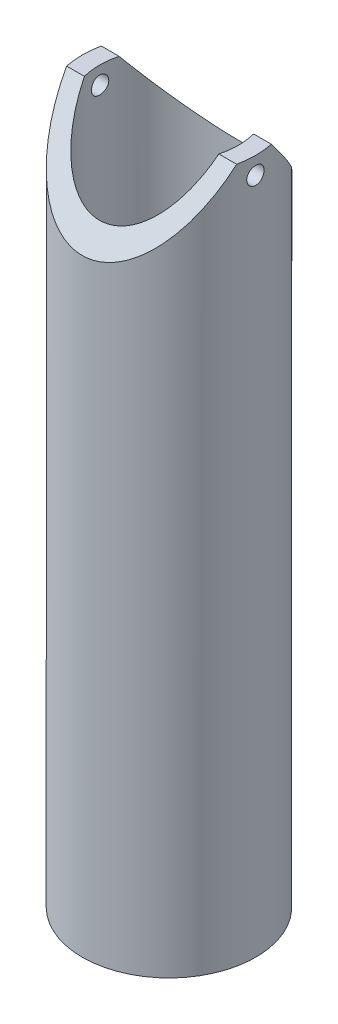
ISO-10303-21;
HEADER;
FILE_DESCRIPTION(('STEP AP214'),'2;1');
FILE_NAME('part.step','',(''),(''),'','','');
FILE_SCHEMA(('AUTOMOTIVE_DESIGN { 1 0 10303 214 1 1 1 1 }'));
ENDSEC;
DATA;
#1=APPLICATION_CONTEXT('core data for automotive mechanical design processes');
#2=APPLICATION_PROTOCOL_DEFINITION('international standard','automotive_design',2000,#1);
#3=PRODUCT_CONTEXT('',#1,'mechanical');
#4=PRODUCT('Part','Part','',(#3));
#5=PRODUCT_RELATED_PRODUCT_CATEGORY('part','',(#4));
#6=PRODUCT_DEFINITION_FORMATION('','',#4);
#7=PRODUCT_DEFINITION_CONTEXT('part definition',#1,'design');
#8=PRODUCT_DEFINITION('design','',#6,#7);
#9=PRODUCT_DEFINITION_SHAPE('','',#8);
#10=(LENGTH_UNIT() NAMED_UNIT(*) SI_UNIT(.MILLI.,.METRE.));
#11=(NAMED_UNIT(*) PLANE_ANGLE_UNIT() SI_UNIT($,.RADIAN.));
#12=(NAMED_UNIT(*) SI_UNIT($,.STERADIAN.) SOLID_ANGLE_UNIT());
#13=UNCERTAINTY_MEASURE_WITH_UNIT(LENGTH_MEASURE(1.E-05),#10,'distance_accuracy_value','');
#14=(GEOMETRIC_REPRESENTATION_CONTEXT(3) GLOBAL_UNCERTAINTY_ASSIGNED_CONTEXT((#13)) GLOBAL_UNIT_ASSIGNED_CONTEXT((#10,
#11,#12)) REPRESENTATION_CONTEXT('',''));
#15=CARTESIAN_POINT('',(0.,0.,0.));
#16=DIRECTION('',(0.,0.,1.));
#17=DIRECTION('',(1.,0.,0.));
#18=AXIS2_PLACEMENT_3D('',#15,#16,#17);
#19=CARTESIAN_POINT('',(0.,200.,0.));
#20=DIRECTION('',(0.,1.,0.));
#21=DIRECTION('',(0.,0.,1.));
#22=AXIS2_PLACEMENT_3D('',#19,#20,#21);
#23=PLANE('',#22);
#24=CARTESIAN_POINT('',(0.,200.,0.));
#25=DIRECTION('',(0.,1.,0.));
#26=DIRECTION('',(0.,0.,1.));
#27=AXIS2_PLACEMENT_3D('',#24,#25,#26);
#28=CIRCLE('',#27,25.);
#29=CARTESIAN_POINT('',(-24.4948974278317,200.,-5.));
#30=VERTEX_POINT('',#29);
#31=CARTESIAN_POINT('',(-24.4948974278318,200.,5.));
#32=VERTEX_POINT('',#31);
#33=EDGE_CURVE('E88',#30,#32,#28,.T.);
#34=ORIENTED_EDGE('',*,*,#33,.T.);
#35=DIRECTION('',(-1.,0.,0.));
#36=VECTOR('',#35,1.);
#37=CARTESIAN_POINT('',(200.,200.,5.));
#38=LINE('',#37,#36);
#39=CARTESIAN_POINT('',(-19.3649167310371,200.,5.));
#40=VERTEX_POINT('',#39);
#41=EDGE_CURVE('E97',#40,#32,#38,.T.);
#42=ORIENTED_EDGE('',*,*,#41,.F.);
#43=CARTESIAN_POINT('',(0.,200.,0.));
#44=DIRECTION('',(0.,1.,0.));
#45=DIRECTION('',(0.,0.,1.));
#46=AXIS2_PLACEMENT_3D('',#43,#44,#45);
#47=CIRCLE('',#46,20.);
#48=CARTESIAN_POINT('',(-19.3649167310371,200.,-5.));
#49=VERTEX_POINT('',#48);
#50=EDGE_CURVE('E140',#49,#40,#47,.T.);
#51=ORIENTED_EDGE('',*,*,#50,.F.);
#52=DIRECTION('',(-1.,0.,0.));
#53=VECTOR('',#52,1.);
#54=CARTESIAN_POINT('',(200.,200.,-5.));
#55=LINE('',#54,#53);
#56=EDGE_CURVE('E57',#49,#30,#55,.T.);
#57=ORIENTED_EDGE('',*,*,#56,.T.);
#58=EDGE_LOOP('',(#34,#42,#51,#57));
#59=FACE_BOUND('',#58,.T.);
#60=ADVANCED_FACE('F34',(#59),#23,.T.);
#61=CARTESIAN_POINT('',(19.3649167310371,200.,5.));
#62=VERTEX_POINT('',#61);
#63=CARTESIAN_POINT('',(19.3649167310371,200.,-5.));
#64=VERTEX_POINT('',#63);
#65=EDGE_CURVE('E108',#62,#64,#47,.T.);
#66=ORIENTED_EDGE('',*,*,#65,.F.);
#67=CARTESIAN_POINT('',(24.4948974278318,200.,5.));
#68=VERTEX_POINT('',#67);
#69=EDGE_CURVE('E65',#68,#62,#38,.T.);
#70=ORIENTED_EDGE('',*,*,#69,.F.);
#71=CARTESIAN_POINT('',(24.4948974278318,200.,-5.));
#72=VERTEX_POINT('',#71);
#73=EDGE_CURVE('E86',#68,#72,#28,.T.);
#74=ORIENTED_EDGE('',*,*,#73,.T.);
#75=EDGE_CURVE('E92',#72,#64,#55,.T.);
#76=ORIENTED_EDGE('',*,*,#75,.T.);
#77=EDGE_LOOP('',(#66,#70,#74,#76));
#78=FACE_BOUND('',#77,.T.);
#79=ADVANCED_FACE('F99',(#78),#23,.T.);
#80=CARTESIAN_POINT('',(0.,200.,0.));
#81=DIRECTION('',(0.,-1.,0.));
#82=DIRECTION('',(0.,0.,-1.));
#83=AXIS2_PLACEMENT_3D('',#80,#81,#82);
#84=CYLINDRICAL_SURFACE('',#83,25.);
#85=CARTESIAN_POINT('',(0.,0.,0.));
#86=DIRECTION('',(0.,1.,0.));
#87=DIRECTION('',(0.,0.,1.));
#88=AXIS2_PLACEMENT_3D('',#85,#86,#87);
#89=CIRCLE('',#88,25.);
#90=CARTESIAN_POINT('',(0.,0.,25.));
#91=VERTEX_POINT('',#90);
#92=EDGE_CURVE('E102',#91,#91,#89,.T.);
#93=ORIENTED_EDGE('',*,*,#92,.T.);
#94=EDGE_LOOP('',(#93));
#95=FACE_BOUND('',#94,.T.);
#96=CARTESIAN_POINT('',(0.,206.25,0.));
#97=DIRECTION('',(0.,0.624695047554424,0.78086880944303));
#98=DIRECTION('',(0.,-0.78086880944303,0.624695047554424));
#99=AXIS2_PLACEMENT_3D('',#96,#97,#98);
#100=ELLIPSE('',#99,40.0195264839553,25.);
#101=EDGE_CURVE('E89',#32,#68,#100,.T.);
#102=ORIENTED_EDGE('',*,*,#101,.F.);
#103=ORIENTED_EDGE('',*,*,#33,.F.);
#104=CARTESIAN_POINT('',(0.,206.25,0.));
#105=DIRECTION('',(0.,0.624695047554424,-0.78086880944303));
#106=DIRECTION('',(0.,-0.78086880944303,-0.624695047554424));
#107=AXIS2_PLACEMENT_3D('',#104,#105,#106);
#108=ELLIPSE('',#107,40.0195264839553,25.);
#109=EDGE_CURVE('E82',#72,#30,#108,.T.);
#110=ORIENTED_EDGE('',*,*,#109,.F.);
#111=ORIENTED_EDGE('',*,*,#73,.F.);
#112=EDGE_LOOP('',(#102,#103,#110,#111));
#113=FACE_BOUND('',#112,.T.);
#114=CARTESIAN_POINT('',(-24.8746859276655,195.,2.5));
#115=CARTESIAN_POINT('',(-24.8746875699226,195.140048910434,2.49999393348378));
#116=CARTESIAN_POINT('',(-24.8758814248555,195.28019042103,2.48819214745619));
#117=CARTESIAN_POINT('',(-24.880527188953,195.556587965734,2.44129078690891));
#118=CARTESIAN_POINT('',(-24.8839815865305,195.692839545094,2.40616553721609));
#119=CARTESIAN_POINT('',(-24.8927533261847,195.957414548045,2.31365029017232));
#120=CARTESIAN_POINT('',(-24.8980695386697,196.085742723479,2.25627379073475));
#121=CARTESIAN_POINT('',(-24.9099645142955,196.330919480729,2.12091066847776));
#122=CARTESIAN_POINT('',(-24.9165430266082,196.447770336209,2.04292813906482));
#123=CARTESIAN_POINT('',(-24.9302481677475,196.667128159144,1.86826190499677));
#124=CARTESIAN_POINT('',(-24.9373765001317,196.769587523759,1.77151854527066));
#125=CARTESIAN_POINT('',(-24.951362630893,196.956844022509,1.56220428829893));
#126=CARTESIAN_POINT('',(-24.9582204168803,197.041640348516,1.44963266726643));
#127=CARTESIAN_POINT('',(-24.9709095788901,197.191328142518,1.21156590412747));
#128=CARTESIAN_POINT('',(-24.9767387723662,197.256177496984,1.08604415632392));
#129=CARTESIAN_POINT('',(-24.9866954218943,197.363861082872,0.825824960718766));
#130=CARTESIAN_POINT('',(-24.9908229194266,197.406695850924,0.691127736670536));
#131=CARTESIAN_POINT('',(-24.9968991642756,197.468994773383,0.416861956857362));
#132=CARTESIAN_POINT('',(-24.9988551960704,197.488537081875,0.277311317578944));
#133=CARTESIAN_POINT('',(-25.0003928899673,197.503938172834,-0.00310185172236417));
#134=CARTESIAN_POINT('',(-24.9999746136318,197.499797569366,-0.143964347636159));
#135=CARTESIAN_POINT('',(-24.9968167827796,197.468013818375,-0.422472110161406));
#136=CARTESIAN_POINT('',(-24.9940855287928,197.44045471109,-0.560127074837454));
#137=CARTESIAN_POINT('',(-24.9866182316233,197.362747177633,-0.82884794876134));
#138=CARTESIAN_POINT('',(-24.9818821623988,197.312598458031,-0.959913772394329));
#139=CARTESIAN_POINT('',(-24.9709234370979,197.191043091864,-1.21200078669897));
#140=CARTESIAN_POINT('',(-24.9646981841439,197.119599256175,-1.33300392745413));
#141=CARTESIAN_POINT('',(-24.9514596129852,196.957508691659,-1.56133378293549));
#142=CARTESIAN_POINT('',(-24.9444462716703,196.866861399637,-1.66866009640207));
#143=CARTESIAN_POINT('',(-24.9303823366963,196.668464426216,-1.86708192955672));
#144=CARTESIAN_POINT('',(-24.9233317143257,196.560641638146,-1.95810436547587));
#145=CARTESIAN_POINT('',(-24.9100184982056,196.331207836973,-2.1207688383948));
#146=CARTESIAN_POINT('',(-24.9037559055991,196.20959680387,-2.19241084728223));
#147=CARTESIAN_POINT('',(-24.8927272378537,195.955982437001,-2.31428046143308));
#148=CARTESIAN_POINT('',(-24.8879614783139,195.823976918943,-2.3645035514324));
#149=CARTESIAN_POINT('',(-24.8804725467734,195.553348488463,-2.44205183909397));
#150=CARTESIAN_POINT('',(-24.8777493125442,195.414725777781,-2.46937773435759));
#151=CARTESIAN_POINT('',(-24.8746645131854,195.135439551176,-2.5002619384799));
#152=CARTESIAN_POINT('',(-24.8742927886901,194.994787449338,-2.50392249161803));
#153=CARTESIAN_POINT('',(-24.8759262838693,194.714871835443,-2.48764061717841));
#154=CARTESIAN_POINT('',(-24.8779314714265,194.575608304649,-2.46769850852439));
#155=CARTESIAN_POINT('',(-24.88408361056,194.302721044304,-2.4048629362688));
#156=CARTESIAN_POINT('',(-24.8882260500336,194.169086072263,-2.36201781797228));
#157=CARTESIAN_POINT('',(-24.8981822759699,193.910899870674,-2.25464179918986));
#158=CARTESIAN_POINT('',(-24.9039961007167,193.786348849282,-2.19011040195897));
#159=CARTESIAN_POINT('',(-24.9166646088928,193.549400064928,-2.04093750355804));
#160=CARTESIAN_POINT('',(-24.9235227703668,193.437045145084,-1.95622824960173));
#161=CARTESIAN_POINT('',(-24.9374958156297,193.228112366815,-1.76920133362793));
#162=CARTESIAN_POINT('',(-24.9446107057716,193.13153489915,-1.66688323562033));
#163=CARTESIAN_POINT('',(-24.9583261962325,192.956545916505,-1.44709951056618));
#164=CARTESIAN_POINT('',(-24.9649248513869,192.878201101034,-1.32958063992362));
#165=CARTESIAN_POINT('',(-24.9768360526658,192.742360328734,-1.08299429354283));
#166=CARTESIAN_POINT('',(-24.9821486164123,192.684864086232,-0.953926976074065));
#167=CARTESIAN_POINT('',(-24.9908802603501,192.592465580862,-0.68814031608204));
#168=CARTESIAN_POINT('',(-24.9943027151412,192.557523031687,-0.5514350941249));
#169=CARTESIAN_POINT('',(-24.9988823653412,192.51109232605,-0.274062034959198));
#170=CARTESIAN_POINT('',(-25.0000396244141,192.499603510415,-0.133394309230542));
#171=CARTESIAN_POINT('',(-24.9999584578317,192.5004156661,0.147255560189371));
#172=CARTESIAN_POINT('',(-24.9987304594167,192.512613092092,0.287238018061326));
#173=CARTESIAN_POINT('',(-24.9940373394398,192.560234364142,0.563154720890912));
#174=CARTESIAN_POINT('',(-24.9905722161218,192.595658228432,0.699088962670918));
#175=CARTESIAN_POINT('',(-24.981793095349,192.688698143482,0.963049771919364));
#176=CARTESIAN_POINT('',(-24.9764793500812,192.746311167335,1.09107741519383));
#177=CARTESIAN_POINT('',(-24.9645953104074,192.882082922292,1.335661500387));
#178=CARTESIAN_POINT('',(-24.9580250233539,192.960241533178,1.45221800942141));
#179=CARTESIAN_POINT('',(-24.9443296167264,193.135274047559,1.67108181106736));
#180=CARTESIAN_POINT('',(-24.9372022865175,193.232225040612,1.77332731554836));
#181=CARTESIAN_POINT('',(-24.9232147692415,193.441938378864,1.96014439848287));
#182=CARTESIAN_POINT('',(-24.9163546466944,193.554704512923,2.04471172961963));
#183=CARTESIAN_POINT('',(-24.903659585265,193.7931608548,2.19394160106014));
#184=CARTESIAN_POINT('',(-24.8978272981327,193.91888320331,2.2585529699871));
#185=CARTESIAN_POINT('',(-24.8878798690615,194.179370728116,2.36566177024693));
#186=CARTESIAN_POINT('',(-24.883762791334,194.314125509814,2.40818414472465));
#187=CARTESIAN_POINT('',(-24.8787501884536,194.541369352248,2.45930422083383));
#188=CARTESIAN_POINT('',(-24.8772332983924,194.632405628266,2.47454428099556));
#189=CARTESIAN_POINT('',(-24.8752006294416,194.815614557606,2.49489414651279));
#190=CARTESIAN_POINT('',(-24.8746848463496,194.907787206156,2.50000399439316));
#191=CARTESIAN_POINT('',(-24.8746859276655,195.,2.5));
#192=B_SPLINE_CURVE_WITH_KNOTS('',3,(#114,#115,#116,#117,#118,#119,#120,#121,#122,#123,#124,
#125,#126,#127,#128,#129,#130,#131,#132,#133,#134,#135,#136,#137,#138,#139,#140,#141,#142,#143,
#144,#145,#146,#147,#148,#149,#150,#151,#152,#153,#154,#155,#156,#157,#158,#159,#160,#161,#162,
#163,#164,#165,#166,#167,#168,#169,#170,#171,#172,#173,#174,#175,#176,#177,#178,#179,#180,#181,
#182,#183,#184,#185,#186,#187,#188,#189,#190,#191),.UNSPECIFIED.,.T.,.F.,(4,2,2,2,2,2,2,2,2,2,2,
2,2,2,2,2,2,2,2,2,2,2,2,2,2,2,2,2,2,2,2,2,2,2,2,2,2,2,4),(0.,0.419809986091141,0.84008287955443,
1.26010122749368,1.6800362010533,2.10132903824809,2.52264114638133,2.9448367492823,
3.36702206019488,3.78778677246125,4.20854057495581,4.62779079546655,5.04704646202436,
5.46703863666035,5.88704313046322,6.30888562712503,6.73072873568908,7.15266072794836,
7.57457986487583,7.99467490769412,8.41476427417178,8.83397036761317,9.25318606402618,
9.67382974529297,10.0944838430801,10.516653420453,10.9388172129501,11.360224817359,
11.7816205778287,12.2011783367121,12.6207364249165,13.0402372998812,13.45973572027,
13.8809928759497,14.3023511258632,14.7247810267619,15.14673287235,15.4231506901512,
15.6995673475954),.UNSPECIFIED.);
#193=CARTESIAN_POINT('',(-24.8746859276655,195.,2.5));
#194=VERTEX_POINT('',#193);
#195=EDGE_CURVE('E129',#194,#194,#192,.T.);
#196=ORIENTED_EDGE('',*,*,#195,.F.);
#197=EDGE_LOOP('',(#196));
#198=FACE_BOUND('',#197,.T.);
#199=CARTESIAN_POINT('',(24.8746859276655,195.,2.5));
#200=CARTESIAN_POINT('',(24.8746875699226,194.859951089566,2.49999393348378));
#201=CARTESIAN_POINT('',(24.8758814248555,194.71980957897,2.48819214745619));
#202=CARTESIAN_POINT('',(24.880527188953,194.443412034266,2.44129078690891));
#203=CARTESIAN_POINT('',(24.8839815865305,194.307160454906,2.40616553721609));
#204=CARTESIAN_POINT('',(24.8927533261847,194.042585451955,2.31365029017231));
#205=CARTESIAN_POINT('',(24.8980695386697,193.914257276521,2.25627379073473));
#206=CARTESIAN_POINT('',(24.9099645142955,193.669080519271,2.12091066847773));
#207=CARTESIAN_POINT('',(24.9165430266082,193.552229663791,2.04292813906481));
#208=CARTESIAN_POINT('',(24.9302481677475,193.332871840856,1.86826190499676));
#209=CARTESIAN_POINT('',(24.9373765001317,193.230412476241,1.77151854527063));
#210=CARTESIAN_POINT('',(24.951362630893,193.043155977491,1.56220428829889));
#211=CARTESIAN_POINT('',(24.9582204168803,192.958359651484,1.44963266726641));
#212=CARTESIAN_POINT('',(24.9709095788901,192.808671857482,1.21156590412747));
#213=CARTESIAN_POINT('',(24.9767387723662,192.743822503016,1.08604415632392));
#214=CARTESIAN_POINT('',(24.9866954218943,192.636138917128,0.825824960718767));
#215=CARTESIAN_POINT('',(24.9908229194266,192.593304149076,0.691127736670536));
#216=CARTESIAN_POINT('',(24.9968991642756,192.531005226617,0.416861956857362));
#217=CARTESIAN_POINT('',(24.9988551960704,192.511462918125,0.277311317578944));
#218=CARTESIAN_POINT('',(25.0003928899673,192.496061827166,-0.00310185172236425));
#219=CARTESIAN_POINT('',(24.9999746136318,192.500202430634,-0.143964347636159));
#220=CARTESIAN_POINT('',(24.9968167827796,192.531986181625,-0.422472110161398));
#221=CARTESIAN_POINT('',(24.9940855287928,192.55954528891,-0.560127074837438));
#222=CARTESIAN_POINT('',(24.9866182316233,192.637252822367,-0.828847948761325));
#223=CARTESIAN_POINT('',(24.9818821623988,192.687401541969,-0.959913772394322));
#224=CARTESIAN_POINT('',(24.9709234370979,192.808956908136,-1.21200078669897));
#225=CARTESIAN_POINT('',(24.9646981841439,192.880400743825,-1.33300392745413));
#226=CARTESIAN_POINT('',(24.9514596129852,193.042491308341,-1.56133378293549));
#227=CARTESIAN_POINT('',(24.9444462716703,193.133138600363,-1.66866009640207));
#228=CARTESIAN_POINT('',(24.9303823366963,193.331535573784,-1.86708192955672));
#229=CARTESIAN_POINT('',(24.9233317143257,193.439358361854,-1.95810436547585));
#230=CARTESIAN_POINT('',(24.9100184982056,193.668792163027,-2.12076883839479));
#231=CARTESIAN_POINT('',(24.9037559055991,193.79040319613,-2.19241084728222));
#232=CARTESIAN_POINT('',(24.8927272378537,194.044017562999,-2.31428046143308));
#233=CARTESIAN_POINT('',(24.8879614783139,194.176023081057,-2.3645035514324));
#234=CARTESIAN_POINT('',(24.8804725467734,194.446651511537,-2.44205183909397));
#235=CARTESIAN_POINT('',(24.8777493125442,194.585274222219,-2.46937773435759));
#236=CARTESIAN_POINT('',(24.8746645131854,194.864560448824,-2.5002619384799));
#237=CARTESIAN_POINT('',(24.8742927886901,195.005212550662,-2.50392249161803));
#238=CARTESIAN_POINT('',(24.8759262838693,195.285128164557,-2.4876406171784));
#239=CARTESIAN_POINT('',(24.8779314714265,195.424391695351,-2.46769850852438));
#240=CARTESIAN_POINT('',(24.88408361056,195.697278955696,-2.4048629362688));
#241=CARTESIAN_POINT('',(24.8882260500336,195.830913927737,-2.36201781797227));
#242=CARTESIAN_POINT('',(24.8981822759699,196.089100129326,-2.25464179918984));
#243=CARTESIAN_POINT('',(24.9039961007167,196.213651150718,-2.19011040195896));
#244=CARTESIAN_POINT('',(24.9166646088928,196.450599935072,-2.04093750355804));
#245=CARTESIAN_POINT('',(24.9235227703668,196.562954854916,-1.95622824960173));
#246=CARTESIAN_POINT('',(24.9374958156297,196.771887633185,-1.76920133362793));
#247=CARTESIAN_POINT('',(24.9446107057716,196.86846510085,-1.66688323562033));
#248=CARTESIAN_POINT('',(24.9583261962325,197.043454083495,-1.44709951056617));
#249=CARTESIAN_POINT('',(24.9649248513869,197.121798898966,-1.32958063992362));
#250=CARTESIAN_POINT('',(24.9768360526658,197.257639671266,-1.08299429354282));
#251=CARTESIAN_POINT('',(24.9821486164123,197.315135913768,-0.953926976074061));
#252=CARTESIAN_POINT('',(24.9908802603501,197.407534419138,-0.688140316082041));
#253=CARTESIAN_POINT('',(24.9943027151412,197.442476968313,-0.551435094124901));
#254=CARTESIAN_POINT('',(24.9988823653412,197.48890767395,-0.274062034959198));
#255=CARTESIAN_POINT('',(25.0000396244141,197.500396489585,-0.133394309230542));
#256=CARTESIAN_POINT('',(24.9999584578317,197.4995843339,0.147255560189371));
#257=CARTESIAN_POINT('',(24.9987304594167,197.487386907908,0.287238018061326));
#258=CARTESIAN_POINT('',(24.9940373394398,197.439765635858,0.563154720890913));
#259=CARTESIAN_POINT('',(24.9905722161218,197.404341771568,0.699088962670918));
#260=CARTESIAN_POINT('',(24.981793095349,197.311301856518,0.963049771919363));
#261=CARTESIAN_POINT('',(24.9764793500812,197.253688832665,1.09107741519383));
#262=CARTESIAN_POINT('',(24.9645953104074,197.117917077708,1.335661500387));
#263=CARTESIAN_POINT('',(24.9580250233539,197.039758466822,1.45221800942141));
#264=CARTESIAN_POINT('',(24.9443296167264,196.864725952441,1.67108181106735));
#265=CARTESIAN_POINT('',(24.9372022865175,196.767774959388,1.77332731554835));
#266=CARTESIAN_POINT('',(24.9232147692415,196.558061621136,1.96014439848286));
#267=CARTESIAN_POINT('',(24.9163546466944,196.445295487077,2.04471172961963));
#268=CARTESIAN_POINT('',(24.903659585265,196.2068391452,2.19394160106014));
#269=CARTESIAN_POINT('',(24.8978272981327,196.08111679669,2.2585529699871));
#270=CARTESIAN_POINT('',(24.8878798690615,195.820629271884,2.36566177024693));
#271=CARTESIAN_POINT('',(24.883762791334,195.685874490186,2.40818414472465));
#272=CARTESIAN_POINT('',(24.8787501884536,195.458630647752,2.45930422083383));
#273=CARTESIAN_POINT('',(24.8772332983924,195.367594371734,2.47454428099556));
#274=CARTESIAN_POINT('',(24.8752006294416,195.184385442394,2.49489414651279));
#275=CARTESIAN_POINT('',(24.8746848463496,195.092212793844,2.50000399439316));
#276=CARTESIAN_POINT('',(24.8746859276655,195.,2.5));
#277=B_SPLINE_CURVE_WITH_KNOTS('',3,(#199,#200,#201,#202,#203,#204,#205,#206,#207,#208,#209,
#210,#211,#212,#213,#214,#215,#216,#217,#218,#219,#220,#221,#222,#223,#224,#225,#226,#227,#228,
#229,#230,#231,#232,#233,#234,#235,#236,#237,#238,#239,#240,#241,#242,#243,#244,#245,#246,#247,
#248,#249,#250,#251,#252,#253,#254,#255,#256,#257,#258,#259,#260,#261,#262,#263,#264,#265,#266,
#267,#268,#269,#270,#271,#272,#273,#274,#275,#276),.UNSPECIFIED.,.T.,.F.,(4,2,2,2,2,2,2,2,2,2,2,
2,2,2,2,2,2,2,2,2,2,2,2,2,2,2,2,2,2,2,2,2,2,2,2,2,2,2,4),(0.,0.419809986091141,0.84008287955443,
1.26010122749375,1.6800362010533,2.10132903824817,2.52264114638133,2.9448367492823,
3.36702206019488,3.78778677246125,4.20854057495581,4.62779079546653,5.04704646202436,
5.46703863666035,5.88704313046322,6.30888562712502,6.73072873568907,7.15266072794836,
7.57457986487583,7.99467490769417,8.41476427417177,8.8339703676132,9.25318606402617,
9.67382974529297,10.0944838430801,10.516653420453,10.9388172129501,11.360224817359,
11.7816205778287,12.2011783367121,12.6207364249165,13.0402372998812,13.45973572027,
13.8809928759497,14.3023511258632,14.7247810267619,15.14673287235,15.4231506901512,
15.6995673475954),.UNSPECIFIED.);
#278=CARTESIAN_POINT('',(24.8746859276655,195.,2.5));
#279=VERTEX_POINT('',#278);
#280=EDGE_CURVE('E135',#279,#279,#277,.T.);
#281=ORIENTED_EDGE('',*,*,#280,.F.);
#282=EDGE_LOOP('',(#281));
#283=FACE_BOUND('',#282,.T.);
#284=ADVANCED_FACE('F36',(#95,#113,#198,#283),#84,.T.);
#285=CARTESIAN_POINT('',(0.,200.,0.));
#286=DIRECTION('',(0.,-1.,0.));
#287=DIRECTION('',(0.,0.,-1.));
#288=AXIS2_PLACEMENT_3D('',#285,#286,#287);
#289=CYLINDRICAL_SURFACE('',#288,20.);
#290=CARTESIAN_POINT('',(-19.8431348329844,195.,2.5));
#291=CARTESIAN_POINT('',(-19.8431368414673,195.1398362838,2.49999405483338));
#292=CARTESIAN_POINT('',(-19.8446289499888,195.279759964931,2.4882278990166));
#293=CARTESIAN_POINT('',(-19.8504339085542,195.555713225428,2.44147641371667));
#294=CARTESIAN_POINT('',(-19.8547497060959,195.691738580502,2.40646682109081));
#295=CARTESIAN_POINT('',(-19.8657057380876,195.955859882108,2.31427669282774));
#296=CARTESIAN_POINT('',(-19.8723443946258,196.083961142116,2.25711120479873));
#297=CARTESIAN_POINT('',(-19.8871962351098,196.328728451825,2.12226419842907));
#298=CARTESIAN_POINT('',(-19.8954091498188,196.445396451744,2.04458618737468));
#299=CARTESIAN_POINT('',(-19.9125355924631,196.664662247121,1.87045345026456));
#300=CARTESIAN_POINT('',(-19.9214524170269,196.767186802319,1.77390681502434));
#301=CARTESIAN_POINT('',(-19.9389523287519,196.954622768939,1.5649752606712));
#302=CARTESIAN_POINT('',(-19.9475353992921,197.039533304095,1.45258955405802));
#303=CARTESIAN_POINT('',(-19.96343444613,197.189593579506,1.21470983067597));
#304=CARTESIAN_POINT('',(-19.9707461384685,197.2546770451,1.08917369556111));
#305=CARTESIAN_POINT('',(-19.9832423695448,197.362811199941,0.828846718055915));
#306=CARTESIAN_POINT('',(-19.9884269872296,197.405862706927,0.69405621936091));
#307=CARTESIAN_POINT('',(-19.9960616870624,197.468492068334,0.419795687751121));
#308=CARTESIAN_POINT('',(-19.9985259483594,197.488191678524,0.280353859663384));
#309=CARTESIAN_POINT('',(-20.0004906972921,197.503935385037,0.000123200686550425));
#310=CARTESIAN_POINT('',(-19.9999913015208,197.499980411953,-0.140665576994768));
#311=CARTESIAN_POINT('',(-19.9960964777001,197.468624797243,-0.418765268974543));
#312=CARTESIAN_POINT('',(-19.9927172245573,197.441355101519,-0.556091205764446));
#313=CARTESIAN_POINT('',(-19.9834605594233,197.36434882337,-0.824202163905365));
#314=CARTESIAN_POINT('',(-19.9775830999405,197.314611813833,-0.954987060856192));
#315=CARTESIAN_POINT('',(-19.9639625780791,197.193943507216,-1.20670881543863));
#316=CARTESIAN_POINT('',(-19.9562145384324,197.12295554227,-1.32761822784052));
#317=CARTESIAN_POINT('',(-19.9397196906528,196.961841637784,-1.55585745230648));
#318=CARTESIAN_POINT('',(-19.9309728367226,196.871714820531,-1.66318664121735));
#319=CARTESIAN_POINT('',(-19.9133886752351,196.674148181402,-1.86198803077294));
#320=CARTESIAN_POINT('',(-19.9045511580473,196.566594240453,-1.953346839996));
#321=CARTESIAN_POINT('',(-19.8878407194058,196.337618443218,-2.11673285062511));
#322=CARTESIAN_POINT('',(-19.8799678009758,196.216196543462,-2.18875999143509));
#323=CARTESIAN_POINT('',(-19.8660780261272,195.962830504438,-2.31144457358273));
#324=CARTESIAN_POINT('',(-19.8600619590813,195.830881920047,-2.36209292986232));
#325=CARTESIAN_POINT('',(-19.8505824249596,195.560260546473,-2.44048165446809));
#326=CARTESIAN_POINT('',(-19.847118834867,195.421588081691,-2.46822312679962));
#327=CARTESIAN_POINT('',(-19.8431588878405,195.142456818,-2.49986043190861));
#328=CARTESIAN_POINT('',(-19.8426426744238,195.002016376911,-2.50391584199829));
#329=CARTESIAN_POINT('',(-19.8445834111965,194.722458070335,-2.48848695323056));
#330=CARTESIAN_POINT('',(-19.8470402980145,194.583340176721,-2.46900315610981));
#331=CARTESIAN_POINT('',(-19.8546322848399,194.310854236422,-2.40718328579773));
#332=CARTESIAN_POINT('',(-19.8597583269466,194.17746838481,-2.36492448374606));
#333=CARTESIAN_POINT('',(-19.8721036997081,193.919675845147,-2.25883371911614));
#334=CARTESIAN_POINT('',(-19.8793231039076,193.795269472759,-2.19500099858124));
#335=CARTESIAN_POINT('',(-19.8950893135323,193.558245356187,-2.04718202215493));
#336=CARTESIAN_POINT('',(-19.9036429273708,193.445693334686,-1.96309111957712));
#337=CARTESIAN_POINT('',(-19.9210923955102,193.236243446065,-1.77729074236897));
#338=CARTESIAN_POINT('',(-19.9299882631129,193.139346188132,-1.67558058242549));
#339=CARTESIAN_POINT('',(-19.9471808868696,192.963395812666,-1.45673177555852));
#340=CARTESIAN_POINT('',(-19.9554739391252,192.884447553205,-1.33950849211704));
#341=CARTESIAN_POINT('',(-19.9704711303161,192.747361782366,-1.0933725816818));
#342=CARTESIAN_POINT('',(-19.9771753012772,192.689223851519,-0.964460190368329));
#343=CARTESIAN_POINT('',(-19.9882229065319,192.595582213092,-0.69895385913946));
#344=CARTESIAN_POINT('',(-19.992572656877,192.560017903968,-0.562381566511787));
#345=CARTESIAN_POINT('',(-19.9984475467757,192.512335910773,-0.28514605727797));
#346=CARTESIAN_POINT('',(-19.9999728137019,192.500217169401,-0.144483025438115));
#347=CARTESIAN_POINT('',(-20.0000262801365,192.499790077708,0.135917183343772));
#348=CARTESIAN_POINT('',(-19.998574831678,192.511320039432,0.275654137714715));
#349=CARTESIAN_POINT('',(-19.9928784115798,192.557520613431,0.55118774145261));
#350=CARTESIAN_POINT('',(-19.9886334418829,192.592191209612,0.686984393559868));
#351=CARTESIAN_POINT('',(-19.9778248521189,192.68363811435,0.950761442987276));
#352=CARTESIAN_POINT('',(-19.9712620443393,192.740406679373,1.07874456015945));
#353=CARTESIAN_POINT('',(-19.9565444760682,192.874421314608,1.32339333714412));
#354=CARTESIAN_POINT('',(-19.9483896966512,192.951667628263,1.44005886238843));
#355=CARTESIAN_POINT('',(-19.9313319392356,193.125043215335,1.65958676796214));
#356=CARTESIAN_POINT('',(-19.9224244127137,193.22129279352,1.76235378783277));
#357=CARTESIAN_POINT('',(-19.9049015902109,193.429692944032,1.95034111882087));
#358=CARTESIAN_POINT('',(-19.8962863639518,193.541847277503,2.03555726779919));
#359=CARTESIAN_POINT('',(-19.8802881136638,193.779369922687,2.18630524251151));
#360=CARTESIAN_POINT('',(-19.8729099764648,193.904787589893,2.2517597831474));
#361=CARTESIAN_POINT('',(-19.8602785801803,194.164856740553,2.36058528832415));
#362=CARTESIAN_POINT('',(-19.8550230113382,194.299497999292,2.40398027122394));
#363=CARTESIAN_POINT('',(-19.8485078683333,194.529029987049,2.45706589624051));
#364=CARTESIAN_POINT('',(-19.8465030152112,194.62247295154,2.47314303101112));
#365=CARTESIAN_POINT('',(-19.8438158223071,194.810597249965,2.49461205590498));
#366=CARTESIAN_POINT('',(-19.8431334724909,194.905278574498,2.50000402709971));
#367=CARTESIAN_POINT('',(-19.8431348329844,195.,2.5));
#368=B_SPLINE_CURVE_WITH_KNOTS('',3,(#290,#291,#292,#293,#294,#295,#296,#297,#298,#299,#300,
#301,#302,#303,#304,#305,#306,#307,#308,#309,#310,#311,#312,#313,#314,#315,#316,#317,#318,#319,
#320,#321,#322,#323,#324,#325,#326,#327,#328,#329,#330,#331,#332,#333,#334,#335,#336,#337,#338,
#339,#340,#341,#342,#343,#344,#345,#346,#347,#348,#349,#350,#351,#352,#353,#354,#355,#356,#357,
#358,#359,#360,#361,#362,#363,#364,#365,#366,#367),.UNSPECIFIED.,.T.,.F.,(4,2,2,2,2,2,2,2,2,2,2,
2,2,2,2,2,2,2,2,2,2,2,2,2,2,2,2,2,2,2,2,2,2,2,2,2,2,2,4),(0.,0.41916281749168,0.838763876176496,
1.25808045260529,1.6773253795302,2.09866577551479,2.52002712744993,2.94278186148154,
3.36552090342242,3.7860459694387,4.20655449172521,4.62471664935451,5.04288675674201,
5.46218204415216,5.88149656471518,6.30367697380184,6.72585870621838,7.14821966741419,
7.570560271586,7.990052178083,8.40953514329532,8.82760376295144,9.24568707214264,
9.66597819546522,10.0862856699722,10.5089888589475,10.9316835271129,11.3532385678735,
11.7747745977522,12.1934381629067,12.612101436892,13.030618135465,13.4491398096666,
13.8704012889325,14.2917625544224,14.7147509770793,15.1372778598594,15.4212098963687,
15.7051397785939),.UNSPECIFIED.);
#369=CARTESIAN_POINT('',(-19.8431348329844,195.,2.5));
#370=VERTEX_POINT('',#369);
#371=EDGE_CURVE('E109',#370,#370,#368,.T.);
#372=ORIENTED_EDGE('',*,*,#371,.T.);
#373=EDGE_LOOP('',(#372));
#374=FACE_BOUND('',#373,.T.);
#375=CARTESIAN_POINT('',(0.,0.,0.));
#376=DIRECTION('',(0.,1.,0.));
#377=DIRECTION('',(0.,0.,1.));
#378=AXIS2_PLACEMENT_3D('',#375,#376,#377);
#379=CIRCLE('',#378,20.);
#380=CARTESIAN_POINT('',(0.,0.,20.));
#381=VERTEX_POINT('',#380);
#382=EDGE_CURVE('E105',#381,#381,#379,.T.);
#383=ORIENTED_EDGE('',*,*,#382,.F.);
#384=EDGE_LOOP('',(#383));
#385=FACE_BOUND('',#384,.T.);
#386=ORIENTED_EDGE('',*,*,#50,.T.);
#387=CARTESIAN_POINT('',(0.,206.25,0.));
#388=DIRECTION('',(0.,0.624695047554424,0.78086880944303));
#389=DIRECTION('',(0.,-0.78086880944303,0.624695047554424));
#390=AXIS2_PLACEMENT_3D('',#387,#388,#389);
#391=ELLIPSE('',#390,32.0156211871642,20.);
#392=EDGE_CURVE('E11',#40,#62,#391,.T.);
#393=ORIENTED_EDGE('',*,*,#392,.T.);
#394=ORIENTED_EDGE('',*,*,#65,.T.);
#395=CARTESIAN_POINT('',(0.,206.25,0.));
#396=DIRECTION('',(0.,0.624695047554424,-0.78086880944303));
#397=DIRECTION('',(0.,-0.78086880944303,-0.624695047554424));
#398=AXIS2_PLACEMENT_3D('',#395,#396,#397);
#399=ELLIPSE('',#398,32.0156211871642,20.);
#400=EDGE_CURVE('E49',#64,#49,#399,.T.);
#401=ORIENTED_EDGE('',*,*,#400,.T.);
#402=EDGE_LOOP('',(#386,#393,#394,#401));
#403=FACE_BOUND('',#402,.T.);
#404=CARTESIAN_POINT('',(19.8431348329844,195.,2.5));
#405=CARTESIAN_POINT('',(19.8431368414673,194.8601637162,2.49999405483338));
#406=CARTESIAN_POINT('',(19.8446289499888,194.720240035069,2.4882278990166));
#407=CARTESIAN_POINT('',(19.8504339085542,194.444286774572,2.44147641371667));
#408=CARTESIAN_POINT('',(19.8547497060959,194.308261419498,2.40646682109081));
#409=CARTESIAN_POINT('',(19.8657057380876,194.044140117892,2.31427669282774));
#410=CARTESIAN_POINT('',(19.8723443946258,193.916038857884,2.25711120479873));
#411=CARTESIAN_POINT('',(19.8871962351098,193.671271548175,2.12226419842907));
#412=CARTESIAN_POINT('',(19.8954091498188,193.554603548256,2.04458618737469));
#413=CARTESIAN_POINT('',(19.9125355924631,193.335337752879,1.87045345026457));
#414=CARTESIAN_POINT('',(19.9214524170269,193.232813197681,1.77390681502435));
#415=CARTESIAN_POINT('',(19.9389523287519,193.045377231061,1.5649752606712));
#416=CARTESIAN_POINT('',(19.9475353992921,192.960466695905,1.45258955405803));
#417=CARTESIAN_POINT('',(19.96343444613,192.810406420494,1.21470983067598));
#418=CARTESIAN_POINT('',(19.9707461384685,192.7453229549,1.08917369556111));
#419=CARTESIAN_POINT('',(19.9832423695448,192.637188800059,0.828846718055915));
#420=CARTESIAN_POINT('',(19.9884269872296,192.594137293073,0.694056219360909));
#421=CARTESIAN_POINT('',(19.9960616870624,192.531507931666,0.419795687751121));
#422=CARTESIAN_POINT('',(19.9985259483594,192.511808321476,0.280353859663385));
#423=CARTESIAN_POINT('',(20.0004906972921,192.496064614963,0.000123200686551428));
#424=CARTESIAN_POINT('',(19.9999913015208,192.500019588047,-0.140665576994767));
#425=CARTESIAN_POINT('',(19.9960964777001,192.531375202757,-0.418765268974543));
#426=CARTESIAN_POINT('',(19.9927172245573,192.558644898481,-0.556091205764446));
#427=CARTESIAN_POINT('',(19.9834605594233,192.63565117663,-0.824202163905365));
#428=CARTESIAN_POINT('',(19.9775830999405,192.685388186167,-0.954987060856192));
#429=CARTESIAN_POINT('',(19.9639625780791,192.806056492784,-1.20670881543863));
#430=CARTESIAN_POINT('',(19.9562145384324,192.87704445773,-1.32761822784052));
#431=CARTESIAN_POINT('',(19.9397196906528,193.038158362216,-1.55585745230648));
#432=CARTESIAN_POINT('',(19.9309728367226,193.128285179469,-1.66318664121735));
#433=CARTESIAN_POINT('',(19.9133886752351,193.325851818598,-1.86198803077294));
#434=CARTESIAN_POINT('',(19.9045511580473,193.433405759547,-1.953346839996));
#435=CARTESIAN_POINT('',(19.8878407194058,193.662381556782,-2.11673285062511));
#436=CARTESIAN_POINT('',(19.8799678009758,193.783803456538,-2.18875999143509));
#437=CARTESIAN_POINT('',(19.8660780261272,194.037169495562,-2.31144457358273));
#438=CARTESIAN_POINT('',(19.8600619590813,194.169118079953,-2.36209292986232));
#439=CARTESIAN_POINT('',(19.8505824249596,194.439739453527,-2.44048165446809));
#440=CARTESIAN_POINT('',(19.847118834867,194.578411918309,-2.46822312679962));
#441=CARTESIAN_POINT('',(19.8431588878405,194.857543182,-2.49986043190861));
#442=CARTESIAN_POINT('',(19.8426426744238,194.997983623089,-2.50391584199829));
#443=CARTESIAN_POINT('',(19.8445834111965,195.277541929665,-2.48848695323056));
#444=CARTESIAN_POINT('',(19.8470402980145,195.416659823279,-2.4690031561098));
#445=CARTESIAN_POINT('',(19.8546322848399,195.689145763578,-2.40718328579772));
#446=CARTESIAN_POINT('',(19.8597583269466,195.82253161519,-2.36492448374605));
#447=CARTESIAN_POINT('',(19.8721036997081,196.080324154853,-2.25883371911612));
#448=CARTESIAN_POINT('',(19.8793231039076,196.204730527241,-2.19500099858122));
#449=CARTESIAN_POINT('',(19.8950893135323,196.441754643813,-2.04718202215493));
#450=CARTESIAN_POINT('',(19.9036429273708,196.554306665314,-1.96309111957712));
#451=CARTESIAN_POINT('',(19.9210923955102,196.763756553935,-1.77729074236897));
#452=CARTESIAN_POINT('',(19.9299882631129,196.860653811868,-1.67558058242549));
#453=CARTESIAN_POINT('',(19.9471808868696,197.036604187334,-1.45673177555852));
#454=CARTESIAN_POINT('',(19.9554739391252,197.115552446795,-1.33950849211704));
#455=CARTESIAN_POINT('',(19.9704711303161,197.252638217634,-1.0933725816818));
#456=CARTESIAN_POINT('',(19.9771753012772,197.310776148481,-0.964460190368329));
#457=CARTESIAN_POINT('',(19.9882229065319,197.404417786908,-0.69895385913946));
#458=CARTESIAN_POINT('',(19.992572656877,197.439982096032,-0.562381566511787));
#459=CARTESIAN_POINT('',(19.9984475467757,197.487664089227,-0.28514605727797));
#460=CARTESIAN_POINT('',(19.9999728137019,197.499782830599,-0.144483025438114));
#461=CARTESIAN_POINT('',(20.0000262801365,197.500209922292,0.135917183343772));
#462=CARTESIAN_POINT('',(19.998574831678,197.488679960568,0.275654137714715));
#463=CARTESIAN_POINT('',(19.9928784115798,197.442479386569,0.55118774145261));
#464=CARTESIAN_POINT('',(19.9886334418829,197.407808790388,0.68698439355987));
#465=CARTESIAN_POINT('',(19.9778248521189,197.31636188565,0.950761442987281));
#466=CARTESIAN_POINT('',(19.9712620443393,197.259593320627,1.07874456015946));
#467=CARTESIAN_POINT('',(19.9565444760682,197.125578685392,1.32339333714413));
#468=CARTESIAN_POINT('',(19.9483896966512,197.048332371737,1.44005886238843));
#469=CARTESIAN_POINT('',(19.9313319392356,196.874956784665,1.65958676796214));
#470=CARTESIAN_POINT('',(19.9224244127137,196.77870720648,1.76235378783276));
#471=CARTESIAN_POINT('',(19.9049015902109,196.570307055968,1.95034111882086));
#472=CARTESIAN_POINT('',(19.8962863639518,196.458152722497,2.03555726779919));
#473=CARTESIAN_POINT('',(19.8802881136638,196.220630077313,2.18630524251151));
#474=CARTESIAN_POINT('',(19.8729099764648,196.095212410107,2.2517597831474));
#475=CARTESIAN_POINT('',(19.8602785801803,195.835143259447,2.36058528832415));
#476=CARTESIAN_POINT('',(19.8550230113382,195.700502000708,2.40398027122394));
#477=CARTESIAN_POINT('',(19.8485078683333,195.470970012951,2.45706589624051));
#478=CARTESIAN_POINT('',(19.8465030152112,195.37752704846,2.47314303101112));
#479=CARTESIAN_POINT('',(19.8438158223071,195.189402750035,2.49461205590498));
#480=CARTESIAN_POINT('',(19.8431334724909,195.094721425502,2.50000402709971));
#481=CARTESIAN_POINT('',(19.8431348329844,195.,2.5));
#482=B_SPLINE_CURVE_WITH_KNOTS('',3,(#404,#405,#406,#407,#408,#409,#410,#411,#412,#413,#414,
#415,#416,#417,#418,#419,#420,#421,#422,#423,#424,#425,#426,#427,#428,#429,#430,#431,#432,#433,
#434,#435,#436,#437,#438,#439,#440,#441,#442,#443,#444,#445,#446,#447,#448,#449,#450,#451,#452,
#453,#454,#455,#456,#457,#458,#459,#460,#461,#462,#463,#464,#465,#466,#467,#468,#469,#470,#471,
#472,#473,#474,#475,#476,#477,#478,#479,#480,#481),.UNSPECIFIED.,.T.,.F.,(4,2,2,2,2,2,2,2,2,2,2,
2,2,2,2,2,2,2,2,2,2,2,2,2,2,2,2,2,2,2,2,2,2,2,2,2,2,2,4),(0.,0.41916281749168,0.838763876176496,
1.25808045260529,1.6773253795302,2.09866577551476,2.52002712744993,2.94278186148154,
3.36552090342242,3.7860459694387,4.20655449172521,4.62471664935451,5.04288675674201,
5.46218204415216,5.88149656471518,6.30367697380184,6.72585870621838,7.14821966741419,
7.570560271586,7.990052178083,8.40953514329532,8.82760376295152,9.24568707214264,
9.66597819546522,10.0862856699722,10.5089888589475,10.9316835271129,11.3532385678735,
11.7747745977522,12.1934381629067,12.612101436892,13.030618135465,13.4491398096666,
13.8704012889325,14.2917625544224,14.7147509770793,15.1372778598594,15.4212098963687,
15.7051397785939),.UNSPECIFIED.);
#483=CARTESIAN_POINT('',(19.8431348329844,195.,2.5));
#484=VERTEX_POINT('',#483);
#485=EDGE_CURVE('E39',#484,#484,#482,.T.);
#486=ORIENTED_EDGE('',*,*,#485,.T.);
#487=EDGE_LOOP('',(#486));
#488=FACE_BOUND('',#487,.T.);
#489=ADVANCED_FACE('F114',(#374,#385,#403,#488),#289,.F.);
#490=CARTESIAN_POINT('',(0.,0.,0.));
#491=DIRECTION('',(0.,1.,0.));
#492=DIRECTION('',(0.,0.,1.));
#493=AXIS2_PLACEMENT_3D('',#490,#491,#492);
#494=PLANE('',#493);
#495=ORIENTED_EDGE('',*,*,#92,.F.);
#496=EDGE_LOOP('',(#495));
#497=FACE_BOUND('',#496,.T.);
#498=ORIENTED_EDGE('',*,*,#382,.T.);
#499=EDGE_LOOP('',(#498));
#500=FACE_BOUND('',#499,.T.);
#501=ADVANCED_FACE('F147',(#497,#500),#494,.F.);
#502=CARTESIAN_POINT('',(200.,175.,-25.));
#503=DIRECTION('',(0.,0.624695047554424,-0.78086880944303));
#504=DIRECTION('',(0.,0.78086880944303,0.624695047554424));
#505=AXIS2_PLACEMENT_3D('',#502,#503,#504);
#506=PLANE('',#505);
#507=ORIENTED_EDGE('',*,*,#109,.T.);
#508=ORIENTED_EDGE('',*,*,#56,.F.);
#509=ORIENTED_EDGE('',*,*,#400,.F.);
#510=ORIENTED_EDGE('',*,*,#75,.F.);
#511=EDGE_LOOP('',(#507,#508,#509,#510));
#512=FACE_BOUND('',#511,.T.);
#513=ADVANCED_FACE('F93',(#512),#506,.T.);
#514=CARTESIAN_POINT('',(200.,200.,5.));
#515=DIRECTION('',(0.,0.624695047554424,0.78086880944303));
#516=DIRECTION('',(0.,-0.78086880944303,0.624695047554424));
#517=AXIS2_PLACEMENT_3D('',#514,#515,#516);
#518=PLANE('',#517);
#519=ORIENTED_EDGE('',*,*,#101,.T.);
#520=ORIENTED_EDGE('',*,*,#69,.T.);
#521=ORIENTED_EDGE('',*,*,#392,.F.);
#522=ORIENTED_EDGE('',*,*,#41,.T.);
#523=EDGE_LOOP('',(#519,#520,#521,#522));
#524=FACE_BOUND('',#523,.T.);
#525=ADVANCED_FACE('F171',(#524),#518,.T.);
#526=CARTESIAN_POINT('',(200.,195.,0.));
#527=DIRECTION('',(-1.,0.,0.));
#528=DIRECTION('',(0.,0.,1.));
#529=AXIS2_PLACEMENT_3D('',#526,#527,#528);
#530=CYLINDRICAL_SURFACE('',#529,2.5);
#531=ORIENTED_EDGE('',*,*,#371,.F.);
#532=EDGE_LOOP('',(#531));
#533=FACE_BOUND('',#532,.T.);
#534=ORIENTED_EDGE('',*,*,#195,.T.);
#535=EDGE_LOOP('',(#534));
#536=FACE_BOUND('',#535,.T.);
#537=ADVANCED_FACE('F122',(#533,#536),#530,.F.);
#538=ORIENTED_EDGE('',*,*,#485,.F.);
#539=EDGE_LOOP('',(#538));
#540=FACE_BOUND('',#539,.T.);
#541=ORIENTED_EDGE('',*,*,#280,.T.);
#542=EDGE_LOOP('',(#541));
#543=FACE_BOUND('',#542,.T.);
#544=ADVANCED_FACE('F118',(#540,#543),#530,.F.);
#545=CLOSED_SHELL('',(#60,#79,#284,#489,#501,#513,#525,#537,#544));
#546=MANIFOLD_SOLID_BREP('B2',#545);
#547=ADVANCED_BREP_SHAPE_REPRESENTATION('',(#18,#546),#14);
#548=SHAPE_DEFINITION_REPRESENTATION(#9,#547);
ENDSEC;
END-ISO-10303-21;
